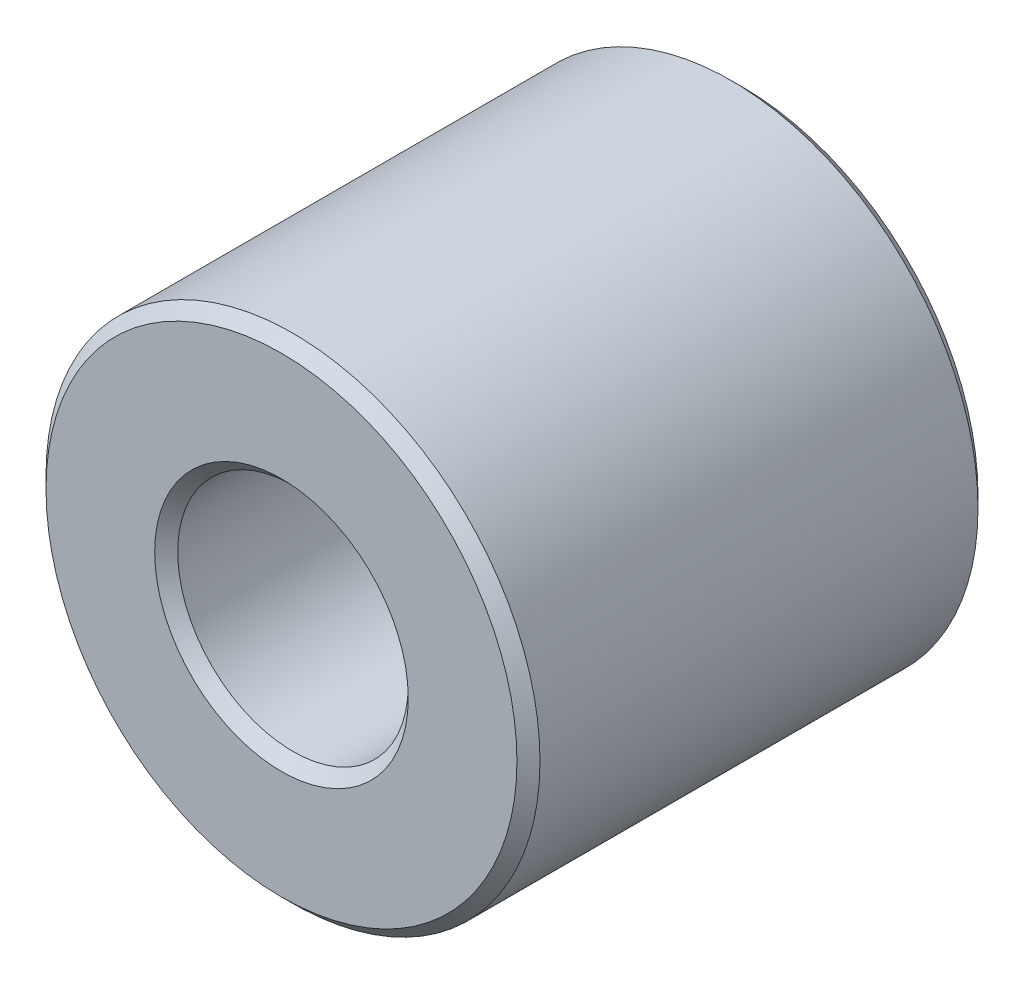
ISO-10303-21;
HEADER;
FILE_DESCRIPTION(('STEP AP214'),'2;1');
FILE_NAME('part.step','',(''),(''),'','','');
FILE_SCHEMA(('AUTOMOTIVE_DESIGN { 1 0 10303 214 1 1 1 1 }'));
ENDSEC;
DATA;
#1=APPLICATION_CONTEXT('core data for automotive mechanical design processes');
#2=APPLICATION_PROTOCOL_DEFINITION('international standard','automotive_design',2000,#1);
#3=PRODUCT_CONTEXT('',#1,'mechanical');
#4=PRODUCT('Part','Part','',(#3));
#5=PRODUCT_RELATED_PRODUCT_CATEGORY('part','',(#4));
#6=PRODUCT_DEFINITION_FORMATION('','',#4);
#7=PRODUCT_DEFINITION_CONTEXT('part definition',#1,'design');
#8=PRODUCT_DEFINITION('design','',#6,#7);
#9=PRODUCT_DEFINITION_SHAPE('','',#8);
#10=(LENGTH_UNIT() NAMED_UNIT(*) SI_UNIT(.MILLI.,.METRE.));
#11=(NAMED_UNIT(*) PLANE_ANGLE_UNIT() SI_UNIT($,.RADIAN.));
#12=(NAMED_UNIT(*) SI_UNIT($,.STERADIAN.) SOLID_ANGLE_UNIT());
#13=UNCERTAINTY_MEASURE_WITH_UNIT(LENGTH_MEASURE(1.E-05),#10,'distance_accuracy_value','');
#14=(GEOMETRIC_REPRESENTATION_CONTEXT(3) GLOBAL_UNCERTAINTY_ASSIGNED_CONTEXT((#13)) GLOBAL_UNIT_ASSIGNED_CONTEXT((#10,
#11,#12)) REPRESENTATION_CONTEXT('',''));
#15=CARTESIAN_POINT('',(0.,0.,0.));
#16=DIRECTION('',(0.,0.,1.));
#17=DIRECTION('',(1.,0.,0.));
#18=AXIS2_PLACEMENT_3D('',#15,#16,#17);
#19=CARTESIAN_POINT('',(0.,0.,14.));
#20=DIRECTION('',(0.,0.,1.));
#21=DIRECTION('',(1.,0.,0.));
#22=AXIS2_PLACEMENT_3D('',#19,#20,#21);
#23=PLANE('',#22);
#24=CARTESIAN_POINT('',(0.,0.,14.));
#25=DIRECTION('',(0.,0.,1.));
#26=DIRECTION('',(1.,0.,0.));
#27=AXIS2_PLACEMENT_3D('',#24,#25,#26);
#28=CIRCLE('',#27,7.69999999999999);
#29=CARTESIAN_POINT('',(7.69999999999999,0.,14.));
#30=VERTEX_POINT('',#29);
#31=EDGE_CURVE('E10',#30,#30,#28,.F.);
#32=ORIENTED_EDGE('',*,*,#31,.T.);
#33=EDGE_LOOP('',(#32));
#34=FACE_BOUND('',#33,.T.);
#35=CARTESIAN_POINT('',(0.,0.,14.));
#36=DIRECTION('',(0.,0.,1.));
#37=DIRECTION('',(1.,0.,0.));
#38=AXIS2_PLACEMENT_3D('',#35,#36,#37);
#39=CIRCLE('',#38,14.3);
#40=CARTESIAN_POINT('',(14.3,0.,14.));
#41=VERTEX_POINT('',#40);
#42=EDGE_CURVE('E40',#41,#41,#39,.T.);
#43=ORIENTED_EDGE('',*,*,#42,.T.);
#44=EDGE_LOOP('',(#43));
#45=FACE_BOUND('',#44,.T.);
#46=ADVANCED_FACE('F33',(#34,#45),#23,.T.);
#47=CARTESIAN_POINT('',(0.,0.,-14.));
#48=DIRECTION('',(0.,0.,1.));
#49=DIRECTION('',(1.,0.,0.));
#50=AXIS2_PLACEMENT_3D('',#47,#48,#49);
#51=PLANE('',#50);
#52=CARTESIAN_POINT('',(0.,0.,-14.));
#53=DIRECTION('',(0.,0.,1.));
#54=DIRECTION('',(1.,0.,0.));
#55=AXIS2_PLACEMENT_3D('',#52,#53,#54);
#56=CIRCLE('',#55,7.69999999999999);
#57=CARTESIAN_POINT('',(7.69999999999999,0.,-14.));
#58=VERTEX_POINT('',#57);
#59=EDGE_CURVE('E59',#58,#58,#56,.T.);
#60=ORIENTED_EDGE('',*,*,#59,.T.);
#61=EDGE_LOOP('',(#60));
#62=FACE_BOUND('',#61,.T.);
#63=CARTESIAN_POINT('',(0.,0.,-14.));
#64=DIRECTION('',(0.,0.,1.));
#65=DIRECTION('',(1.,0.,0.));
#66=AXIS2_PLACEMENT_3D('',#63,#64,#65);
#67=CIRCLE('',#66,14.3);
#68=CARTESIAN_POINT('',(14.3,0.,-14.));
#69=VERTEX_POINT('',#68);
#70=EDGE_CURVE('E62',#69,#69,#67,.F.);
#71=ORIENTED_EDGE('',*,*,#70,.T.);
#72=EDGE_LOOP('',(#71));
#73=FACE_BOUND('',#72,.T.);
#74=ADVANCED_FACE('F66',(#62,#73),#51,.F.);
#75=CARTESIAN_POINT('',(0.,0.,14.));
#76=DIRECTION('',(0.,0.,-1.));
#77=DIRECTION('',(-1.,0.,0.));
#78=AXIS2_PLACEMENT_3D('',#75,#76,#77);
#79=CYLINDRICAL_SURFACE('',#78,15.);
#80=CARTESIAN_POINT('',(0.,0.,-13.3));
#81=DIRECTION('',(0.,0.,1.));
#82=DIRECTION('',(1.,0.,0.));
#83=AXIS2_PLACEMENT_3D('',#80,#81,#82);
#84=CIRCLE('',#83,15.);
#85=CARTESIAN_POINT('',(15.,0.,-13.3));
#86=VERTEX_POINT('',#85);
#87=EDGE_CURVE('E44',#86,#86,#84,.T.);
#88=ORIENTED_EDGE('',*,*,#87,.T.);
#89=EDGE_LOOP('',(#88));
#90=FACE_BOUND('',#89,.T.);
#91=CARTESIAN_POINT('',(0.,0.,13.3));
#92=DIRECTION('',(0.,0.,1.));
#93=DIRECTION('',(1.,0.,0.));
#94=AXIS2_PLACEMENT_3D('',#91,#92,#93);
#95=CIRCLE('',#94,15.);
#96=CARTESIAN_POINT('',(15.,0.,13.3));
#97=VERTEX_POINT('',#96);
#98=EDGE_CURVE('E48',#97,#97,#95,.F.);
#99=ORIENTED_EDGE('',*,*,#98,.T.);
#100=EDGE_LOOP('',(#99));
#101=FACE_BOUND('',#100,.T.);
#102=ADVANCED_FACE('F76',(#90,#101),#79,.T.);
#103=CARTESIAN_POINT('',(0.,0.,14.));
#104=DIRECTION('',(0.,0.,-1.));
#105=DIRECTION('',(-1.,0.,0.));
#106=AXIS2_PLACEMENT_3D('',#103,#104,#105);
#107=CYLINDRICAL_SURFACE('',#106,7.);
#108=CARTESIAN_POINT('',(0.,0.,-13.3));
#109=DIRECTION('',(0.,0.,1.));
#110=DIRECTION('',(1.,0.,0.));
#111=AXIS2_PLACEMENT_3D('',#108,#109,#110);
#112=CIRCLE('',#111,7.);
#113=CARTESIAN_POINT('',(7.,0.,-13.3));
#114=VERTEX_POINT('',#113);
#115=EDGE_CURVE('E53',#114,#114,#112,.F.);
#116=ORIENTED_EDGE('',*,*,#115,.T.);
#117=EDGE_LOOP('',(#116));
#118=FACE_BOUND('',#117,.T.);
#119=CARTESIAN_POINT('',(0.,0.,13.3));
#120=DIRECTION('',(0.,0.,1.));
#121=DIRECTION('',(1.,0.,0.));
#122=AXIS2_PLACEMENT_3D('',#119,#120,#121);
#123=CIRCLE('',#122,7.);
#124=CARTESIAN_POINT('',(7.,0.,13.3));
#125=VERTEX_POINT('',#124);
#126=EDGE_CURVE('E56',#125,#125,#123,.T.);
#127=ORIENTED_EDGE('',*,*,#126,.T.);
#128=EDGE_LOOP('',(#127));
#129=FACE_BOUND('',#128,.T.);
#130=ADVANCED_FACE('F79',(#118,#129),#107,.F.);
#131=CARTESIAN_POINT('',(0.,0.,-14.));
#132=DIRECTION('',(0.,0.,-1.));
#133=DIRECTION('',(-1.,0.,0.));
#134=AXIS2_PLACEMENT_3D('',#131,#132,#133);
#135=CONICAL_SURFACE('',#134,7.69999999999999,0.78539816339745);
#136=ORIENTED_EDGE('',*,*,#115,.F.);
#137=EDGE_LOOP('',(#136));
#138=FACE_BOUND('',#137,.T.);
#139=ORIENTED_EDGE('',*,*,#59,.F.);
#140=EDGE_LOOP('',(#139));
#141=FACE_BOUND('',#140,.T.);
#142=ADVANCED_FACE('F72',(#138,#141),#135,.F.);
#143=CARTESIAN_POINT('',(0.,0.,-13.3));
#144=DIRECTION('',(0.,0.,1.));
#145=DIRECTION('',(1.,0.,0.));
#146=AXIS2_PLACEMENT_3D('',#143,#144,#145);
#147=CONICAL_SURFACE('',#146,15.,0.785398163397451);
#148=CARTESIAN_POINT('',(14.3,0.,-14.));
#149=CARTESIAN_POINT('',(14.3072916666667,0.,-13.9927083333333));
#150=CARTESIAN_POINT('',(14.3145833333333,0.,-13.9854166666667));
#151=CARTESIAN_POINT('',(14.3291666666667,0.,-13.9708333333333));
#152=CARTESIAN_POINT('',(14.3364583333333,0.,-13.9635416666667));
#153=CARTESIAN_POINT('',(14.3510416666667,0.,-13.9489583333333));
#154=CARTESIAN_POINT('',(14.3583333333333,0.,-13.9416666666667));
#155=CARTESIAN_POINT('',(14.3729166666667,0.,-13.9270833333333));
#156=CARTESIAN_POINT('',(14.3802083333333,0.,-13.9197916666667));
#157=CARTESIAN_POINT('',(14.3947916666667,0.,-13.9052083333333));
#158=CARTESIAN_POINT('',(14.4020833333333,0.,-13.8979166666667));
#159=CARTESIAN_POINT('',(14.4166666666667,0.,-13.8833333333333));
#160=CARTESIAN_POINT('',(14.4239583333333,0.,-13.8760416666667));
#161=CARTESIAN_POINT('',(14.4385416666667,0.,-13.8614583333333));
#162=CARTESIAN_POINT('',(14.4458333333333,0.,-13.8541666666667));
#163=CARTESIAN_POINT('',(14.4604166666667,0.,-13.8395833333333));
#164=CARTESIAN_POINT('',(14.4677083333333,0.,-13.8322916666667));
#165=CARTESIAN_POINT('',(14.4822916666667,0.,-13.8177083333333));
#166=CARTESIAN_POINT('',(14.4895833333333,0.,-13.8104166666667));
#167=CARTESIAN_POINT('',(14.5041666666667,0.,-13.7958333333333));
#168=CARTESIAN_POINT('',(14.5114583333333,0.,-13.7885416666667));
#169=CARTESIAN_POINT('',(14.5260416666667,0.,-13.7739583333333));
#170=CARTESIAN_POINT('',(14.5333333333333,0.,-13.7666666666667));
#171=CARTESIAN_POINT('',(14.5479166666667,0.,-13.7520833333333));
#172=CARTESIAN_POINT('',(14.5552083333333,0.,-13.7447916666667));
#173=CARTESIAN_POINT('',(14.5697916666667,0.,-13.7302083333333));
#174=CARTESIAN_POINT('',(14.5770833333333,0.,-13.7229166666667));
#175=CARTESIAN_POINT('',(14.5916666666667,0.,-13.7083333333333));
#176=CARTESIAN_POINT('',(14.5989583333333,0.,-13.7010416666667));
#177=CARTESIAN_POINT('',(14.6135416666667,0.,-13.6864583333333));
#178=CARTESIAN_POINT('',(14.6208333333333,0.,-13.6791666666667));
#179=CARTESIAN_POINT('',(14.6354166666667,0.,-13.6645833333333));
#180=CARTESIAN_POINT('',(14.6427083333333,0.,-13.6572916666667));
#181=CARTESIAN_POINT('',(14.6572916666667,0.,-13.6427083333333));
#182=CARTESIAN_POINT('',(14.6645833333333,0.,-13.6354166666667));
#183=CARTESIAN_POINT('',(14.6791666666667,0.,-13.6208333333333));
#184=CARTESIAN_POINT('',(14.6864583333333,0.,-13.6135416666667));
#185=CARTESIAN_POINT('',(14.7010416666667,0.,-13.5989583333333));
#186=CARTESIAN_POINT('',(14.7083333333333,0.,-13.5916666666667));
#187=CARTESIAN_POINT('',(14.7229166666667,0.,-13.5770833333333));
#188=CARTESIAN_POINT('',(14.7302083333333,0.,-13.5697916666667));
#189=CARTESIAN_POINT('',(14.7447916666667,0.,-13.5552083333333));
#190=CARTESIAN_POINT('',(14.7520833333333,0.,-13.5479166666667));
#191=CARTESIAN_POINT('',(14.7666666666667,0.,-13.5333333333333));
#192=CARTESIAN_POINT('',(14.7739583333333,0.,-13.5260416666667));
#193=CARTESIAN_POINT('',(14.7885416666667,0.,-13.5114583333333));
#194=CARTESIAN_POINT('',(14.7958333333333,0.,-13.5041666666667));
#195=CARTESIAN_POINT('',(14.8104166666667,0.,-13.4895833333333));
#196=CARTESIAN_POINT('',(14.8177083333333,0.,-13.4822916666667));
#197=CARTESIAN_POINT('',(14.8322916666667,0.,-13.4677083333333));
#198=CARTESIAN_POINT('',(14.8395833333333,0.,-13.4604166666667));
#199=CARTESIAN_POINT('',(14.8541666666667,0.,-13.4458333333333));
#200=CARTESIAN_POINT('',(14.8614583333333,0.,-13.4385416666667));
#201=CARTESIAN_POINT('',(14.8760416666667,0.,-13.4239583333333));
#202=CARTESIAN_POINT('',(14.8833333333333,0.,-13.4166666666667));
#203=CARTESIAN_POINT('',(14.8979166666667,0.,-13.4020833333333));
#204=CARTESIAN_POINT('',(14.9052083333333,0.,-13.3947916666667));
#205=CARTESIAN_POINT('',(14.9197916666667,0.,-13.3802083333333));
#206=CARTESIAN_POINT('',(14.9270833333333,0.,-13.3729166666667));
#207=CARTESIAN_POINT('',(14.9416666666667,0.,-13.3583333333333));
#208=CARTESIAN_POINT('',(14.9489583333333,0.,-13.3510416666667));
#209=CARTESIAN_POINT('',(14.9635416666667,0.,-13.3364583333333));
#210=CARTESIAN_POINT('',(14.9708333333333,0.,-13.3291666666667));
#211=CARTESIAN_POINT('',(14.9854166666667,0.,-13.3145833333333));
#212=CARTESIAN_POINT('',(14.9927083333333,0.,-13.3072916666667));
#213=CARTESIAN_POINT('',(15.,0.,-13.3));
#214=B_SPLINE_CURVE_WITH_KNOTS('',3,(#148,#149,#150,#151,#152,#153,#154,#155,#156,#157,#158,
#159,#160,#161,#162,#163,#164,#165,#166,#167,#168,#169,#170,#171,#172,#173,#174,#175,#176,#177,
#178,#179,#180,#181,#182,#183,#184,#185,#186,#187,#188,#189,#190,#191,#192,#193,#194,#195,#196,
#197,#198,#199,#200,#201,#202,#203,#204,#205,#206,#207,#208,#209,#210,#211,#212,#213),
.UNSPECIFIED.,.F.,.F.,(4,2,2,2,2,2,2,2,2,2,2,2,2,2,2,2,2,2,2,2,2,2,2,2,2,2,2,2,2,2,2,2,4),(0.,
0.0309359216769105,0.061871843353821,0.0928077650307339,0.123743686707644,0.154679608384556,
0.185615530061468,0.21655145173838,0.247487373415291,0.278423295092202,0.309359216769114,
0.340295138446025,0.371231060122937,0.402166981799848,0.43310290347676,0.464038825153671,
0.494974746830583,0.525910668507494,0.556846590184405,0.587782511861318,0.618718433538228,
0.64965435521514,0.680590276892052,0.711526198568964,0.742462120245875,0.773398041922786,
0.804333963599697,0.835269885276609,0.866205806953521,0.897141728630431,0.928077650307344,
0.959013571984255,0.989949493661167),.UNSPECIFIED.);
#215=EDGE_CURVE('BSEAM68',#69,#86,#214,.T.);
#216=ORIENTED_EDGE('',*,*,#70,.F.);
#217=ORIENTED_EDGE('',*,*,#87,.F.);
#218=ORIENTED_EDGE('',*,*,#215,.T.);
#219=ORIENTED_EDGE('',*,*,#215,.F.);
#220=EDGE_LOOP('',(#216,#218,#217,#219));
#221=FACE_BOUND('',#220,.T.);
#222=ADVANCED_FACE('F68',(#221),#147,.T.);
#223=CARTESIAN_POINT('',(0.,0.,13.3));
#224=DIRECTION('',(0.,0.,1.));
#225=DIRECTION('',(1.,0.,0.));
#226=AXIS2_PLACEMENT_3D('',#223,#224,#225);
#227=CONICAL_SURFACE('',#226,7.,0.785398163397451);
#228=ORIENTED_EDGE('',*,*,#31,.F.);
#229=EDGE_LOOP('',(#228));
#230=FACE_BOUND('',#229,.T.);
#231=ORIENTED_EDGE('',*,*,#126,.F.);
#232=EDGE_LOOP('',(#231));
#233=FACE_BOUND('',#232,.T.);
#234=ADVANCED_FACE('F71',(#230,#233),#227,.F.);
#235=CARTESIAN_POINT('',(0.,0.,14.));
#236=DIRECTION('',(0.,0.,-1.));
#237=DIRECTION('',(-1.,0.,0.));
#238=AXIS2_PLACEMENT_3D('',#235,#236,#237);
#239=CONICAL_SURFACE('',#238,14.3,0.785398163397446);
#240=ORIENTED_EDGE('',*,*,#98,.F.);
#241=EDGE_LOOP('',(#240));
#242=FACE_BOUND('',#241,.T.);
#243=ORIENTED_EDGE('',*,*,#42,.F.);
#244=EDGE_LOOP('',(#243));
#245=FACE_BOUND('',#244,.T.);
#246=ADVANCED_FACE('F35',(#242,#245),#239,.T.);
#247=CLOSED_SHELL('',(#46,#74,#102,#130,#142,#222,#234,#246));
#248=MANIFOLD_SOLID_BREP('B2',#247);
#249=ADVANCED_BREP_SHAPE_REPRESENTATION('',(#18,#248),#14);
#250=SHAPE_DEFINITION_REPRESENTATION(#9,#249);
ENDSEC;
END-ISO-10303-21;
